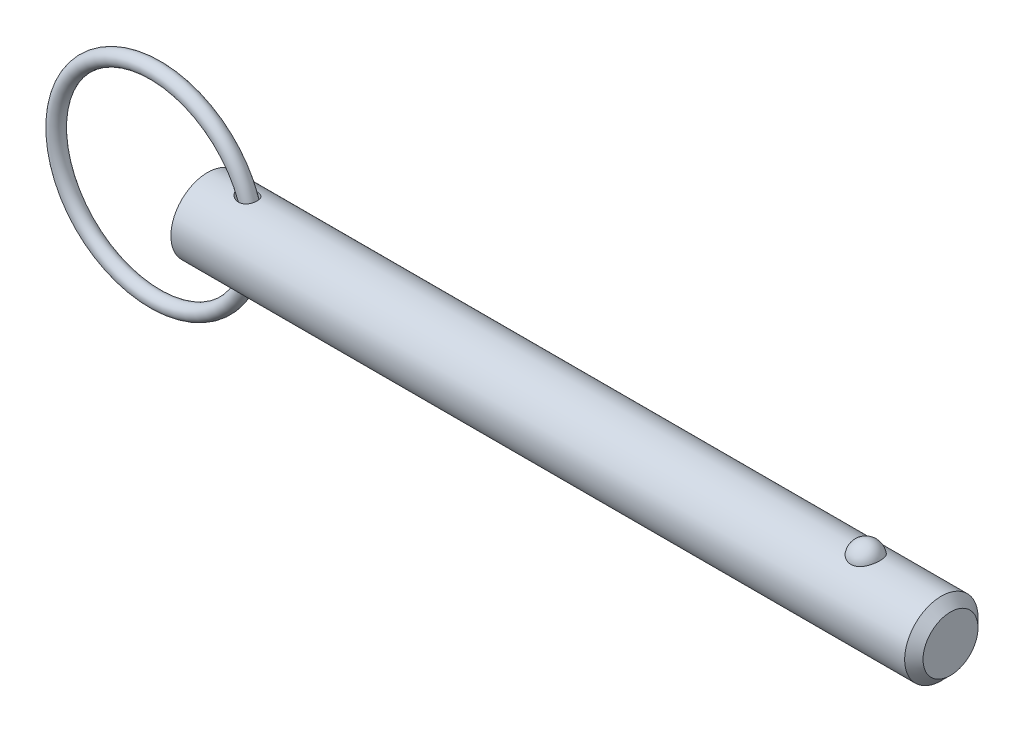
ISO-10303-21;
HEADER;
FILE_DESCRIPTION(('STEP AP214'),'2;1');
FILE_NAME('part.step','',(''),(''),'','','');
FILE_SCHEMA(('AUTOMOTIVE_DESIGN { 1 0 10303 214 1 1 1 1 }'));
ENDSEC;
DATA;
#1=APPLICATION_CONTEXT('core data for automotive mechanical design processes');
#2=APPLICATION_PROTOCOL_DEFINITION('international standard','automotive_design',2000,#1);
#3=PRODUCT_CONTEXT('',#1,'mechanical');
#4=PRODUCT('Part','Part','',(#3));
#5=PRODUCT_RELATED_PRODUCT_CATEGORY('part','',(#4));
#6=PRODUCT_DEFINITION_FORMATION('','',#4);
#7=PRODUCT_DEFINITION_CONTEXT('part definition',#1,'design');
#8=PRODUCT_DEFINITION('design','',#6,#7);
#9=PRODUCT_DEFINITION_SHAPE('','',#8);
#10=(LENGTH_UNIT() NAMED_UNIT(*) SI_UNIT(.MILLI.,.METRE.));
#11=(NAMED_UNIT(*) PLANE_ANGLE_UNIT() SI_UNIT($,.RADIAN.));
#12=(NAMED_UNIT(*) SI_UNIT($,.STERADIAN.) SOLID_ANGLE_UNIT());
#13=UNCERTAINTY_MEASURE_WITH_UNIT(LENGTH_MEASURE(1.E-05),#10,'distance_accuracy_value','');
#14=(GEOMETRIC_REPRESENTATION_CONTEXT(3) GLOBAL_UNCERTAINTY_ASSIGNED_CONTEXT((#13)) GLOBAL_UNIT_ASSIGNED_CONTEXT((#10,
#11,#12)) REPRESENTATION_CONTEXT('',''));
#15=CARTESIAN_POINT('',(0.,0.,0.));
#16=DIRECTION('',(0.,0.,1.));
#17=DIRECTION('',(1.,0.,0.));
#18=AXIS2_PLACEMENT_3D('',#15,#16,#17);
#19=CARTESIAN_POINT('',(-6.70471658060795,0.,0.));
#20=DIRECTION('',(0.,0.,1.));
#21=DIRECTION('',(1.,0.,0.));
#22=AXIS2_PLACEMENT_3D('',#19,#20,#21);
#23=TOROIDAL_SURFACE('',#22,12.7,0.940000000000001);
#24=CARTESIAN_POINT('',(6.93528341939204,0.,0.));
#25=VERTEX_POINT('',#24);
#26=VERTEX_LOOP('',#25);
#27=FACE_BOUND('',#26,.T.);
#28=ADVANCED_FACE('P0_F12',(#27),#23,.T.);
#29=CLOSED_SHELL('',(#28));
#30=MANIFOLD_SOLID_BREP('P0_B1',#29);
#31=CARTESIAN_POINT('',(0.,0.,0.));
#32=DIRECTION('',(1.,0.,0.));
#33=DIRECTION('',(0.,0.,-1.));
#34=AXIS2_PLACEMENT_3D('',#31,#32,#33);
#35=CYLINDRICAL_SURFACE('',#34,4.7);
#36=CARTESIAN_POINT('',(4.16378072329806,4.63584137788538,-0.773934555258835));
#37=CARTESIAN_POINT('',(4.22041228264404,4.62659903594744,-0.829297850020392));
#38=CARTESIAN_POINT('',(4.28206987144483,4.61719767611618,-0.879522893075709));
#39=CARTESIAN_POINT('',(4.41303152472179,4.59925351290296,-0.968997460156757));
#40=CARTESIAN_POINT('',(4.4823442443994,4.59071170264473,-1.00823437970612));
#41=CARTESIAN_POINT('',(4.626507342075,4.5755493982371,-1.07495006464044));
#42=CARTESIAN_POINT('',(4.70135029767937,4.56892638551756,-1.10244426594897));
#43=CARTESIAN_POINT('',(4.85470490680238,4.55848940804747,-1.14483874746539));
#44=CARTESIAN_POINT('',(4.93321503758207,4.55467428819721,-1.15974420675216));
#45=CARTESIAN_POINT('',(5.09197970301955,4.55051176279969,-1.17597559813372));
#46=CARTESIAN_POINT('',(5.17223836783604,4.55017372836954,-1.17726483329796));
#47=CARTESIAN_POINT('',(5.33159446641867,4.55326696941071,-1.16524823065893));
#48=CARTESIAN_POINT('',(5.41069268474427,4.55669556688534,-1.15195276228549));
#49=CARTESIAN_POINT('',(5.55698758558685,4.56647801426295,-1.11249214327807));
#50=CARTESIAN_POINT('',(5.62458628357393,4.57250771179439,-1.08773548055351));
#51=CARTESIAN_POINT('',(5.75397700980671,4.58665356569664,-1.02644632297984));
#52=CARTESIAN_POINT('',(5.81577171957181,4.59476875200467,-0.989919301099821));
#53=CARTESIAN_POINT('',(5.9268148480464,4.61135052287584,-0.909391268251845));
#54=CARTESIAN_POINT('',(5.9766679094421,4.61973919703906,-0.866204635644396));
#55=CARTESIAN_POINT('',(6.06817854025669,4.63643253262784,-0.771868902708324));
#56=CARTESIAN_POINT('',(6.10983710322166,4.64473720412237,-0.720720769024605));
#57=CARTESIAN_POINT('',(6.18318089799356,4.660174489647,-0.612928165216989));
#58=CARTESIAN_POINT('',(6.21503150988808,4.66732544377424,-0.556398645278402));
#59=CARTESIAN_POINT('',(6.26900210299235,4.67985590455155,-0.438689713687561));
#60=CARTESIAN_POINT('',(6.29112194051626,4.68523538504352,-0.377510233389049));
#61=CARTESIAN_POINT('',(6.32523846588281,4.6936733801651,-0.251831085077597));
#62=CARTESIAN_POINT('',(6.33717189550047,4.69671737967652,-0.187313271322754));
#63=CARTESIAN_POINT('',(6.35042407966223,4.70010386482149,-0.0571258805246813));
#64=CARTESIAN_POINT('',(6.3517424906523,4.70044626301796,0.00854373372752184));
#65=CARTESIAN_POINT('',(6.34371729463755,4.69838816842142,0.139481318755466));
#66=CARTESIAN_POINT('',(6.33432596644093,4.69597539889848,0.204746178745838));
#67=CARTESIAN_POINT('',(6.30500866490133,4.68864655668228,0.332720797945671));
#68=CARTESIAN_POINT('',(6.28508259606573,4.68373046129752,0.39543053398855));
#69=CARTESIAN_POINT('',(6.23516511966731,4.67193431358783,0.516455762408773));
#70=CARTESIAN_POINT('',(6.20518126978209,4.66505573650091,0.574774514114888));
#71=CARTESIAN_POINT('',(6.1358631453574,4.65009270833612,0.685387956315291));
#72=CARTESIAN_POINT('',(6.09652950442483,4.64200833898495,0.737683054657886));
#73=CARTESIAN_POINT('',(6.00979078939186,4.62559001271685,0.834455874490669));
#74=CARTESIAN_POINT('',(5.96243625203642,4.61725787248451,0.878979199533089));
#75=CARTESIAN_POINT('',(5.86079843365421,4.60122574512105,0.959378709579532));
#76=CARTESIAN_POINT('',(5.80651591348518,4.59352568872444,0.995255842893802));
#77=CARTESIAN_POINT('',(5.69277386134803,4.57961669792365,1.05741527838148));
#78=CARTESIAN_POINT('',(5.63333134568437,4.57340309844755,1.08372773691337));
#79=CARTESIAN_POINT('',(5.5108424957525,4.56305640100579,1.12650026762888));
#80=CARTESIAN_POINT('',(5.44779577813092,4.55892352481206,1.14295928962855));
#81=CARTESIAN_POINT('',(5.3179566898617,4.55299444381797,1.1663590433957));
#82=CARTESIAN_POINT('',(5.25110869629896,4.55127026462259,1.17300670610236));
#83=CARTESIAN_POINT('',(5.11716812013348,4.55043953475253,1.17622268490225));
#84=CARTESIAN_POINT('',(5.05007546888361,4.55133378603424,1.17278791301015));
#85=CARTESIAN_POINT('',(4.91166083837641,4.55569951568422,1.15571913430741));
#86=CARTESIAN_POINT('',(4.84044690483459,4.55937764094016,1.1412666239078));
#87=CARTESIAN_POINT('',(4.70108819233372,4.56903562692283,1.10196123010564));
#88=CARTESIAN_POINT('',(4.63294574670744,4.57501720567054,1.07710058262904));
#89=CARTESIAN_POINT('',(4.4947730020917,4.58927184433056,1.01474439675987));
#90=CARTESIAN_POINT('',(4.42520748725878,4.59771156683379,0.976252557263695));
#91=CARTESIAN_POINT('',(4.29354165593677,4.61552030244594,0.888246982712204));
#92=CARTESIAN_POINT('',(4.23143936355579,4.62488906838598,0.838736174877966));
#93=CARTESIAN_POINT('',(4.12609666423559,4.64192969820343,0.738015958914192));
#94=CARTESIAN_POINT('',(4.08142630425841,4.64963595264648,0.688308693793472));
#95=CARTESIAN_POINT('',(4.0008117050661,4.66411457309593,0.582144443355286));
#96=CARTESIAN_POINT('',(3.96485623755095,4.6708881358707,0.525696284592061));
#97=CARTESIAN_POINT('',(3.9081839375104,4.68183565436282,0.41591755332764));
#98=CARTESIAN_POINT('',(3.88599581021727,4.68624644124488,0.363372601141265));
#99=CARTESIAN_POINT('',(3.85055971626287,4.693376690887,0.255230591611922));
#100=CARTESIAN_POINT('',(3.83730635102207,4.69609717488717,0.199635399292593));
#101=CARTESIAN_POINT('',(3.82058225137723,4.69954043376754,0.0867104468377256));
#102=CARTESIAN_POINT('',(3.81714632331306,4.70025610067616,0.0293752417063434));
#103=CARTESIAN_POINT('',(3.8204140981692,4.69957935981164,-0.084992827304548));
#104=CARTESIAN_POINT('',(3.82711802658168,4.69818690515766,-0.142025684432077));
#105=CARTESIAN_POINT('',(3.84950128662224,4.69360426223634,-0.250744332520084));
#106=CARTESIAN_POINT('',(3.86463891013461,4.69052274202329,-0.302548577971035));
#107=CARTESIAN_POINT('',(3.9026119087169,4.68295207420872,-0.403121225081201));
#108=CARTESIAN_POINT('',(3.92544863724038,4.67846267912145,-0.451889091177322));
#109=CARTESIAN_POINT('',(3.9799930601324,4.6680441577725,-0.549522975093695));
#110=CARTESIAN_POINT('',(4.01228648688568,4.66202553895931,-0.598050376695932));
#111=CARTESIAN_POINT('',(4.08340845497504,4.64931397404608,-0.689954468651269));
#112=CARTESIAN_POINT('',(4.1222426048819,4.64262045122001,-0.733326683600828));
#113=CARTESIAN_POINT('',(4.16378072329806,4.63584137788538,-0.773934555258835));
#114=B_SPLINE_CURVE_WITH_KNOTS('',3,(#36,#37,#38,#39,#40,#41,#42,#43,#44,#45,#46,#47,#48,#49,
#50,#51,#52,#53,#54,#55,#56,#57,#58,#59,#60,#61,#62,#63,#64,#65,#66,#67,#68,#69,#70,#71,#72,#73,
#74,#75,#76,#77,#78,#79,#80,#81,#82,#83,#84,#85,#86,#87,#88,#89,#90,#91,#92,#93,#94,#95,#96,#97,
#98,#99,#100,#101,#102,#103,#104,#105,#106,#107,#108,#109,#110,#111,#112,#113),.UNSPECIFIED.,
.T.,.F.,(4,2,2,2,2,2,2,2,2,2,2,2,2,2,2,2,2,2,2,2,2,2,2,2,2,2,2,2,2,2,2,2,2,2,2,2,2,2,4),(0.,
0.238977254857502,0.478227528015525,0.717162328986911,0.955998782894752,1.19547875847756,
1.43478857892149,1.65034375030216,1.86579883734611,2.06429861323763,2.2627743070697,
2.45769248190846,2.65261353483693,2.848736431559,3.04486567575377,3.24187227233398,
3.43888065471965,3.63574133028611,3.83258866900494,4.0282389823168,4.22386782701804,
4.41887441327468,4.61390177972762,4.81464443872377,5.0154485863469,5.23282834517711,
5.45037055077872,5.68914354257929,5.9278531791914,6.12887730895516,6.32964104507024,
6.50053592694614,6.67132745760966,6.84272375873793,7.01412387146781,7.17560768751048,
7.33711990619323,7.51225400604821,7.68753905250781),.UNSPECIFIED.);
#115=CARTESIAN_POINT('',(4.16378072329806,4.63584137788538,-0.773934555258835));
#116=VERTEX_POINT('',#115);
#117=EDGE_CURVE('P1_E40',#116,#116,#114,.T.);
#118=ORIENTED_EDGE('',*,*,#117,.T.);
#119=EDGE_LOOP('',(#118));
#120=FACE_BOUND('',#119,.T.);
#121=CARTESIAN_POINT('',(94.075,0.,0.));
#122=DIRECTION('',(1.,0.,0.));
#123=DIRECTION('',(0.,0.,-1.));
#124=AXIS2_PLACEMENT_3D('',#121,#122,#123);
#125=CIRCLE('',#124,4.7);
#126=CARTESIAN_POINT('',(94.075,0.,-4.7));
#127=VERTEX_POINT('',#126);
#128=EDGE_CURVE('P1_E25',#127,#127,#125,.T.);
#129=ORIENTED_EDGE('',*,*,#128,.F.);
#130=EDGE_LOOP('',(#129));
#131=FACE_BOUND('',#130,.T.);
#132=CARTESIAN_POINT('',(0.,0.,0.));
#133=DIRECTION('',(1.,0.,0.));
#134=DIRECTION('',(0.,0.,-1.));
#135=AXIS2_PLACEMENT_3D('',#132,#133,#134);
#136=CIRCLE('',#135,4.7);
#137=CARTESIAN_POINT('',(0.,0.,-4.7));
#138=VERTEX_POINT('',#137);
#139=EDGE_CURVE('P1_E9',#138,#138,#136,.T.);
#140=ORIENTED_EDGE('',*,*,#139,.T.);
#141=EDGE_LOOP('',(#140));
#142=FACE_BOUND('',#141,.T.);
#143=CARTESIAN_POINT('',(84.3806283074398,4.30387706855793,1.88855557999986));
#144=CARTESIAN_POINT('',(84.2828134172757,4.30388592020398,1.88854684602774));
#145=CARTESIAN_POINT('',(84.1848511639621,4.30731231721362,1.88078712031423));
#146=CARTESIAN_POINT('',(83.991662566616,4.32065009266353,1.84993192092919));
#147=CARTESIAN_POINT('',(83.8964438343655,4.33057798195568,1.8267974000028));
#148=CARTESIAN_POINT('',(83.7118175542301,4.35574577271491,1.76594245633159));
#149=CARTESIAN_POINT('',(83.6223953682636,4.370971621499,1.72826059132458));
#150=CARTESIAN_POINT('',(83.4513907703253,4.40507782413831,1.63937301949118));
#151=CARTESIAN_POINT('',(83.369805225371,4.42395670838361,1.58817274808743));
#152=CARTESIAN_POINT('',(83.2139011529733,4.46404088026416,1.47181116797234));
#153=CARTESIAN_POINT('',(83.1398759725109,4.48529915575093,1.40627540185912));
#154=CARTESIAN_POINT('',(83.0035361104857,4.527485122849,1.26387806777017));
#155=CARTESIAN_POINT('',(82.9412249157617,4.54841271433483,1.18701313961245));
#156=CARTESIAN_POINT('',(82.8270723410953,4.58876216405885,1.02025841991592));
#157=CARTESIAN_POINT('',(82.7758113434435,4.60807744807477,0.929944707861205));
#158=CARTESIAN_POINT('',(82.6884245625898,4.6421320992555,0.741468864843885));
#159=CARTESIAN_POINT('',(82.6522995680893,4.65687122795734,0.643306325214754));
#160=CARTESIAN_POINT('',(82.5956718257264,4.68038485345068,0.440967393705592));
#161=CARTESIAN_POINT('',(82.5753048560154,4.68910744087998,0.33674687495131));
#162=CARTESIAN_POINT('',(82.5511323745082,4.69949255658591,0.126059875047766));
#163=CARTESIAN_POINT('',(82.5473260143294,4.70115544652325,0.0195935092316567));
#164=CARTESIAN_POINT('',(82.5563081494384,4.69727256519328,-0.191500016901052));
#165=CARTESIAN_POINT('',(82.5689415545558,4.69179416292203,-0.296135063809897));
#166=CARTESIAN_POINT('',(82.6102760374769,4.67429351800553,-0.501612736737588));
#167=CARTESIAN_POINT('',(82.6389773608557,4.66227117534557,-0.602455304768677));
#168=CARTESIAN_POINT('',(82.7119285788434,4.63286427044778,-0.797707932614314));
#169=CARTESIAN_POINT('',(82.7562044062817,4.61547077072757,-0.89210694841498));
#170=CARTESIAN_POINT('',(82.8594074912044,4.5770990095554,-1.07173134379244));
#171=CARTESIAN_POINT('',(82.9183362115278,4.55612039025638,-1.15695580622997));
#172=CARTESIAN_POINT('',(83.0502161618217,4.51257918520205,-1.31664252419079));
#173=CARTESIAN_POINT('',(83.1232867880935,4.49000423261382,-1.39100294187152));
#174=CARTESIAN_POINT('',(83.2814784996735,4.44594443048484,-1.52598548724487));
#175=CARTESIAN_POINT('',(83.3665990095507,4.42445952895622,-1.58660827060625));
#176=CARTESIAN_POINT('',(83.5452673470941,4.38543655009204,-1.69145998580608));
#177=CARTESIAN_POINT('',(83.6386518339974,4.36783887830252,-1.73594433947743));
#178=CARTESIAN_POINT('',(83.8324220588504,4.3382941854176,-1.80852276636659));
#179=CARTESIAN_POINT('',(83.9328051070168,4.32634500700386,-1.83662309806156));
#180=CARTESIAN_POINT('',(84.1322875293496,4.31005085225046,-1.87453136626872));
#181=CARTESIAN_POINT('',(84.2311967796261,4.30535309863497,-1.88518956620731));
#182=CARTESIAN_POINT('',(84.4295210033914,4.30299844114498,-1.89055986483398));
#183=CARTESIAN_POINT('',(84.5289358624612,4.30534000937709,-1.8852754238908));
#184=CARTESIAN_POINT('',(84.7218638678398,4.31657737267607,-1.85939299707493));
#185=CARTESIAN_POINT('',(84.8154624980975,4.32524571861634,-1.83932621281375));
#186=CARTESIAN_POINT('',(84.9977839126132,4.34791518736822,-1.78507441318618));
#187=CARTESIAN_POINT('',(85.0865063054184,4.36191673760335,-1.75088826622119));
#188=CARTESIAN_POINT('',(85.258694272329,4.39411605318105,-1.66845234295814));
#189=CARTESIAN_POINT('',(85.3420089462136,4.41239631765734,-1.61992036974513));
#190=CARTESIAN_POINT('',(85.499399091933,4.4510924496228,-1.51034589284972));
#191=CARTESIAN_POINT('',(85.5734723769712,4.47150882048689,-1.44930043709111));
#192=CARTESIAN_POINT('',(85.7144058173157,4.51353865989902,-1.31275193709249));
#193=CARTESIAN_POINT('',(85.7807014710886,4.53515983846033,-1.23666813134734));
#194=CARTESIAN_POINT('',(85.9000698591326,4.57635116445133,-1.07425533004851));
#195=CARTESIAN_POINT('',(85.9531402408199,4.5959209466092,-0.987924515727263));
#196=CARTESIAN_POINT('',(86.0464438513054,4.63161819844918,-0.804428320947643));
#197=CARTESIAN_POINT('',(86.0862298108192,4.64762063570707,-0.707010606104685));
#198=CARTESIAN_POINT('',(86.1498257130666,4.6737403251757,-0.506344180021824));
#199=CARTESIAN_POINT('',(86.1736358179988,4.68385763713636,-0.403095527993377));
#200=CARTESIAN_POINT('',(86.2047510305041,4.69716075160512,-0.193975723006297));
#201=CARTESIAN_POINT('',(86.2120987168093,4.70036443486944,-0.088112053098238));
#202=CARTESIAN_POINT('',(86.2102611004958,4.6995691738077,0.123441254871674));
#203=CARTESIAN_POINT('',(86.2010764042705,4.69557049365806,0.229130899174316));
#204=CARTESIAN_POINT('',(86.1664922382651,4.68082941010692,0.43654570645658));
#205=CARTESIAN_POINT('',(86.1412099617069,4.67013575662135,0.538293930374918));
#206=CARTESIAN_POINT('',(86.075050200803,4.64311776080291,0.735797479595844));
#207=CARTESIAN_POINT('',(86.034171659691,4.62679303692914,0.831552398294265));
#208=CARTESIAN_POINT('',(85.9372869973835,4.5900271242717,1.01512750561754));
#209=CARTESIAN_POINT('',(85.8811735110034,4.56955699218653,1.10288523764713));
#210=CARTESIAN_POINT('',(85.7551085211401,4.52671789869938,1.26730106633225));
#211=CARTESIAN_POINT('',(85.6851572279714,4.50434896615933,1.3439593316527));
#212=CARTESIAN_POINT('',(85.5327247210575,4.46008413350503,1.48428028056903));
#213=CARTESIAN_POINT('',(85.4502095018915,4.43818970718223,1.54790656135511));
#214=CARTESIAN_POINT('',(85.2747358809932,4.39746476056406,1.66008504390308));
#215=CARTESIAN_POINT('',(85.1817736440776,4.37863537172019,1.70863168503));
#216=CARTESIAN_POINT('',(84.9910997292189,4.34688784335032,1.78783023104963));
#217=CARTESIAN_POINT('',(84.8936298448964,4.33380220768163,1.81899757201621));
#218=CARTESIAN_POINT('',(84.6944052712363,4.3143515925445,1.86467392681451));
#219=CARTESIAN_POINT('',(84.5926639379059,4.30796708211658,1.87923136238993));
#220=CARTESIAN_POINT('',(84.4539136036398,4.3043503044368,1.88747378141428));
#221=CARTESIAN_POINT('',(84.4172813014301,4.30387375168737,1.88855885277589));
#222=CARTESIAN_POINT('',(84.3806283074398,4.30387706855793,1.88855557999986));
#223=B_SPLINE_CURVE_WITH_KNOTS('',3,(#143,#144,#145,#146,#147,#148,#149,#150,#151,#152,#153,
#154,#155,#156,#157,#158,#159,#160,#161,#162,#163,#164,#165,#166,#167,#168,#169,#170,#171,#172,
#173,#174,#175,#176,#177,#178,#179,#180,#181,#182,#183,#184,#185,#186,#187,#188,#189,#190,#191,
#192,#193,#194,#195,#196,#197,#198,#199,#200,#201,#202,#203,#204,#205,#206,#207,#208,#209,#210,
#211,#212,#213,#214,#215,#216,#217,#218,#219,#220,#221,#222),.UNSPECIFIED.,.T.,.F.,(4,2,2,2,2,2,
2,2,2,2,2,2,2,2,2,2,2,2,2,2,2,2,2,2,2,2,2,2,2,2,2,2,2,2,2,2,2,2,2,4),(0.,0.29333979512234,
0.587427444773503,0.880740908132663,1.17393661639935,1.47597417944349,1.77810150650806,
2.09350493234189,2.40892479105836,2.72703308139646,3.0451250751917,3.36023788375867,
3.6753555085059,3.99100033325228,4.30667668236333,4.62514463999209,4.94359739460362,
5.25676407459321,5.56981105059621,5.86708641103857,6.16429725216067,6.45131888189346,
6.73836351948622,7.03148013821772,7.32466598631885,7.63288296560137,7.94115473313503,
8.25895074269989,8.57674352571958,8.89371340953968,9.21067166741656,9.52534839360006,
9.84004644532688,10.157022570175,10.4739938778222,10.7918388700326,11.1098009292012,
11.4177488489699,11.7247967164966,11.8347163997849),.UNSPECIFIED.);
#224=CARTESIAN_POINT('',(84.3806283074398,4.30387706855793,1.88855557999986));
#225=VERTEX_POINT('',#224);
#226=EDGE_CURVE('P1_E34',#225,#225,#223,.T.);
#227=ORIENTED_EDGE('',*,*,#226,.T.);
#228=EDGE_LOOP('',(#227));
#229=FACE_BOUND('',#228,.T.);
#230=CARTESIAN_POINT('',(4.16378072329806,-4.63584137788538,-0.773934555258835));
#231=CARTESIAN_POINT('',(4.11797605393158,-4.64331682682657,-0.729154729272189));
#232=CARTESIAN_POINT('',(4.07545237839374,-4.65068929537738,-0.681007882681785));
#233=CARTESIAN_POINT('',(3.99850919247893,-4.66454993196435,-0.578483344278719));
#234=CARTESIAN_POINT('',(3.9640846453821,-4.67103864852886,-0.524109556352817));
#235=CARTESIAN_POINT('',(3.90486465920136,-4.68247538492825,-0.409579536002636));
#236=CARTESIAN_POINT('',(3.88014787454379,-4.68741075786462,-0.349380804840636));
#237=CARTESIAN_POINT('',(3.84254060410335,-4.69500854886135,-0.225256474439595));
#238=CARTESIAN_POINT('',(3.8296375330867,-4.69767338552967,-0.161334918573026));
#239=CARTESIAN_POINT('',(3.81750619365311,-4.70018000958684,-0.0396774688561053));
#240=CARTESIAN_POINT('',(3.8168623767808,-4.70031401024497,0.017913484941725));
#241=CARTESIAN_POINT('',(3.82570055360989,-4.69848615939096,0.132270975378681));
#242=CARTESIAN_POINT('',(3.83518142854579,-4.6965245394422,0.189037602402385));
#243=CARTESIAN_POINT('',(3.8627670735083,-4.69091189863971,0.296808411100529));
#244=CARTESIAN_POINT('',(3.88034293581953,-4.68736483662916,0.347956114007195));
#245=CARTESIAN_POINT('',(3.92293217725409,-4.67896699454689,0.446919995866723));
#246=CARTESIAN_POINT('',(3.94794743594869,-4.67411588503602,0.494735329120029));
#247=CARTESIAN_POINT('',(4.00723361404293,-4.66297432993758,0.590975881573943));
#248=CARTESIAN_POINT('',(4.04218787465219,-4.65658759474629,0.638966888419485));
#249=CARTESIAN_POINT('',(4.11850165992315,-4.6432741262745,0.729452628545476));
#250=CARTESIAN_POINT('',(4.15986486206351,-4.63634708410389,0.771944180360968));
#251=CARTESIAN_POINT('',(4.25563139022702,-4.62124878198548,0.858077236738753));
#252=CARTESIAN_POINT('',(4.3110472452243,-4.61307408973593,0.900593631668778));
#253=CARTESIAN_POINT('',(4.42760239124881,-4.59748077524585,0.977085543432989));
#254=CARTESIAN_POINT('',(4.48874590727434,-4.59006271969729,1.01105468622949));
#255=CARTESIAN_POINT('',(4.62409915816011,-4.57577604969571,1.07399161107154));
#256=CARTESIAN_POINT('',(4.69895162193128,-4.56912175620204,1.10163764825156));
#257=CARTESIAN_POINT('',(4.85238616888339,-4.55861611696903,1.14433682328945));
#258=CARTESIAN_POINT('',(4.93096882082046,-4.55476520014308,1.15938803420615));
#259=CARTESIAN_POINT('',(5.08983848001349,-4.55053674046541,1.17587995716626));
#260=CARTESIAN_POINT('',(5.17012835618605,-4.55016559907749,1.17729558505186));
#261=CARTESIAN_POINT('',(5.32956049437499,-4.55319561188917,1.16552635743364));
#262=CARTESIAN_POINT('',(5.40870366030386,-4.55659361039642,1.15235371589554));
#263=CARTESIAN_POINT('',(5.55512154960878,-4.56632591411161,1.11311448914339));
#264=CARTESIAN_POINT('',(5.62279525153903,-4.57233592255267,1.08845479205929));
#265=CARTESIAN_POINT('',(5.75235194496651,-4.58645252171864,1.02734156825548));
#266=CARTESIAN_POINT('',(5.81423750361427,-4.59455817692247,0.990893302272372));
#267=CARTESIAN_POINT('',(5.92544729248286,-4.61112960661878,0.910507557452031));
#268=CARTESIAN_POINT('',(5.9753775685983,-4.61951638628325,0.867388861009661));
#269=CARTESIAN_POINT('',(6.06705041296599,-4.63621447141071,0.773173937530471));
#270=CARTESIAN_POINT('',(6.10879399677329,-4.64452578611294,0.722078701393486));
#271=CARTESIAN_POINT('',(6.18230323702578,-4.65998194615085,0.614385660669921));
#272=CARTESIAN_POINT('',(6.21423602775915,-4.66714520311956,0.557904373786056));
#273=CARTESIAN_POINT('',(6.26837651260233,-4.67970630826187,0.440277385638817));
#274=CARTESIAN_POINT('',(6.29058407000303,-4.68510413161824,0.379131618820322));
#275=CARTESIAN_POINT('',(6.32487950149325,-4.69358284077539,0.253506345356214));
#276=CARTESIAN_POINT('',(6.33690441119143,-4.69664929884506,0.189008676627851));
#277=CARTESIAN_POINT('',(6.3503414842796,-4.70008248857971,0.0588455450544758));
#278=CARTESIAN_POINT('',(6.35175330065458,-4.70044913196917,-0.00681995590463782));
#279=CARTESIAN_POINT('',(6.34391515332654,-4.69843881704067,-0.137767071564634));
#280=CARTESIAN_POINT('',(6.33461722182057,-4.69604951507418,-0.203045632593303));
#281=CARTESIAN_POINT('',(6.30548404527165,-4.68876413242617,-0.331063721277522));
#282=CARTESIAN_POINT('',(6.2856487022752,-4.68386802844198,-0.393803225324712));
#283=CARTESIAN_POINT('',(6.23590713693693,-4.67210599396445,-0.514904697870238));
#284=CARTESIAN_POINT('',(6.20600824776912,-4.66524149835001,-0.573269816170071));
#285=CARTESIAN_POINT('',(6.13685224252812,-4.65029918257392,-0.683989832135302));
#286=CARTESIAN_POINT('',(6.09759575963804,-4.6422214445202,-0.736345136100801));
#287=CARTESIAN_POINT('',(6.01099960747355,-4.62580793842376,-0.833250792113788));
#288=CARTESIAN_POINT('',(5.96371037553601,-4.61747403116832,-0.87784652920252));
#289=CARTESIAN_POINT('',(5.86219002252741,-4.60143050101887,-0.958399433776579));
#290=CARTESIAN_POINT('',(5.80795966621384,-4.59372080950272,-0.994357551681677));
#291=CARTESIAN_POINT('',(5.69431062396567,-4.57978661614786,-1.05668157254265));
#292=CARTESIAN_POINT('',(5.63490936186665,-4.57355737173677,-1.08307825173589));
#293=CARTESIAN_POINT('',(5.51248756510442,-4.56317492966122,-1.12602176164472));
#294=CARTESIAN_POINT('',(5.44946662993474,-4.55902196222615,-1.1425675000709));
#295=CARTESIAN_POINT('',(5.3196775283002,-4.55305083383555,-1.16613984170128));
#296=CARTESIAN_POINT('',(5.25285368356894,-4.55130415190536,-1.17287534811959));
#297=CARTESIAN_POINT('',(5.11894995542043,-4.55042807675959,-1.17626714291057));
#298=CARTESIAN_POINT('',(5.05187000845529,-4.55129938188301,-1.17292074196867));
#299=CARTESIAN_POINT('',(4.91348721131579,-4.55561850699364,-1.15603764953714));
#300=CARTESIAN_POINT('',(4.84229084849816,-4.55927235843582,-1.14168541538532));
#301=CARTESIAN_POINT('',(4.70293860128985,-4.56888540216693,-1.10258192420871));
#302=CARTESIAN_POINT('',(4.63478566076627,-4.57484677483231,-1.07782082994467));
#303=CARTESIAN_POINT('',(4.49401200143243,-4.58932889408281,-1.01452290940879));
#304=CARTESIAN_POINT('',(4.42204931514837,-4.59808779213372,-0.974568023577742));
#305=CARTESIAN_POINT('',(4.28620227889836,-4.61656806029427,-0.88288117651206));
#306=CARTESIAN_POINT('',(4.22231268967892,-4.62628879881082,-0.831156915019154));
#307=CARTESIAN_POINT('',(4.16378072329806,-4.63584137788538,-0.773934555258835));
#308=B_SPLINE_CURVE_WITH_KNOTS('',3,(#230,#231,#232,#233,#234,#235,#236,#237,#238,#239,#240,
#241,#242,#243,#244,#245,#246,#247,#248,#249,#250,#251,#252,#253,#254,#255,#256,#257,#258,#259,
#260,#261,#262,#263,#264,#265,#266,#267,#268,#269,#270,#271,#272,#273,#274,#275,#276,#277,#278,
#279,#280,#281,#282,#283,#284,#285,#286,#287,#288,#289,#290,#291,#292,#293,#294,#295,#296,#297,
#298,#299,#300,#301,#302,#303,#304,#305,#306,#307),.UNSPECIFIED.,.T.,.F.,(4,2,2,2,2,2,2,2,2,2,2,
2,2,2,2,2,2,2,2,2,2,2,2,2,2,2,2,2,2,2,2,2,2,2,2,2,2,2,4),(0.,0.19326332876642,0.386406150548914,
0.581083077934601,0.775552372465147,0.947410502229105,1.11924964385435,1.28117818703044,
1.44314767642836,1.62161944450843,1.80019400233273,2.01034324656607,2.22064874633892,
2.45975127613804,2.69889038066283,2.93846932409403,3.1778478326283,3.39350806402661,
3.60907218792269,3.80761226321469,4.00612769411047,4.20104508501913,4.39596521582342,
4.59208201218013,4.78820522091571,4.98521027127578,5.18221715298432,5.37908078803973,
5.5759311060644,5.77158824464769,5.96722384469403,6.1622240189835,6.35724581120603,
6.55794420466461,6.75869613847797,6.97596054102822,7.19343073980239,7.44055547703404,
7.68751900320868),.UNSPECIFIED.);
#309=CARTESIAN_POINT('',(4.16378072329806,-4.63584137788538,-0.773934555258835));
#310=VERTEX_POINT('',#309);
#311=EDGE_CURVE('P1_E17',#310,#310,#308,.T.);
#312=ORIENTED_EDGE('',*,*,#311,.T.);
#313=EDGE_LOOP('',(#312));
#314=FACE_BOUND('',#313,.T.);
#315=ADVANCED_FACE('P1_F13',(#120,#131,#142,#229,#314),#35,.T.);
#316=CARTESIAN_POINT('',(0.,0.,0.));
#317=DIRECTION('',(-1.,0.,0.));
#318=DIRECTION('',(0.,0.,1.));
#319=AXIS2_PLACEMENT_3D('',#316,#317,#318);
#320=PLANE('',#319);
#321=ORIENTED_EDGE('',*,*,#139,.F.);
#322=EDGE_LOOP('',(#321));
#323=FACE_BOUND('',#322,.T.);
#324=ADVANCED_FACE('P1_F15',(#323),#320,.T.);
#325=CARTESIAN_POINT('',(95.25,0.,0.));
#326=DIRECTION('',(-1.,0.,0.));
#327=DIRECTION('',(0.,0.,1.));
#328=AXIS2_PLACEMENT_3D('',#325,#326,#327);
#329=CONICAL_SURFACE('',#328,3.52500000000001,0.785398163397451);
#330=ORIENTED_EDGE('',*,*,#128,.T.);
#331=EDGE_LOOP('',(#330));
#332=FACE_BOUND('',#331,.T.);
#333=CARTESIAN_POINT('',(95.25,0.,0.));
#334=DIRECTION('',(1.,0.,0.));
#335=DIRECTION('',(0.,0.,-1.));
#336=AXIS2_PLACEMENT_3D('',#333,#334,#335);
#337=CIRCLE('',#336,3.52500000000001);
#338=CARTESIAN_POINT('',(95.25,0.,-3.52500000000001));
#339=VERTEX_POINT('',#338);
#340=EDGE_CURVE('P1_E30',#339,#339,#337,.T.);
#341=ORIENTED_EDGE('',*,*,#340,.F.);
#342=EDGE_LOOP('',(#341));
#343=FACE_BOUND('',#342,.T.);
#344=ADVANCED_FACE('P1_F55',(#332,#343),#329,.T.);
#345=CARTESIAN_POINT('',(95.25,3.52500000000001,0.));
#346=DIRECTION('',(1.,0.,0.));
#347=DIRECTION('',(0.,0.,-1.));
#348=AXIS2_PLACEMENT_3D('',#345,#346,#347);
#349=PLANE('',#348);
#350=ORIENTED_EDGE('',*,*,#340,.T.);
#351=EDGE_LOOP('',(#350));
#352=FACE_BOUND('',#351,.T.);
#353=ADVANCED_FACE('P1_F51',(#352),#349,.T.);
#354=CARTESIAN_POINT('',(84.3806283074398,4.23,0.));
#355=DIRECTION('',(-1.,0.,0.));
#356=DIRECTION('',(0.,1.,0.));
#357=AXIS2_PLACEMENT_3D('',#354,#355,#356);
#358=SPHERICAL_SURFACE('',#357,1.88999999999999);
#359=ORIENTED_EDGE('',*,*,#226,.F.);
#360=EDGE_LOOP('',(#359));
#361=FACE_BOUND('',#360,.T.);
#362=ADVANCED_FACE('P1_F46',(#361),#358,.T.);
#363=CARTESIAN_POINT('',(-6.70471658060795,0.,0.));
#364=DIRECTION('',(0.,0.,1.));
#365=DIRECTION('',(1.,0.,0.));
#366=AXIS2_PLACEMENT_3D('',#363,#364,#365);
#367=TOROIDAL_SURFACE('',#366,12.7,1.175);
#368=ORIENTED_EDGE('',*,*,#311,.F.);
#369=EDGE_LOOP('',(#368));
#370=FACE_BOUND('',#369,.T.);
#371=ORIENTED_EDGE('',*,*,#117,.F.);
#372=EDGE_LOOP('',(#371));
#373=FACE_BOUND('',#372,.T.);
#374=ADVANCED_FACE('P1_F50',(#370,#373),#367,.F.);
#375=CLOSED_SHELL('',(#315,#324,#344,#353,#362,#374));
#376=MANIFOLD_SOLID_BREP('P1_B1',#375);
#377=ADVANCED_BREP_SHAPE_REPRESENTATION('',(#18,#30,#376),#14);
#378=SHAPE_DEFINITION_REPRESENTATION(#9,#377);
ENDSEC;
END-ISO-10303-21;
